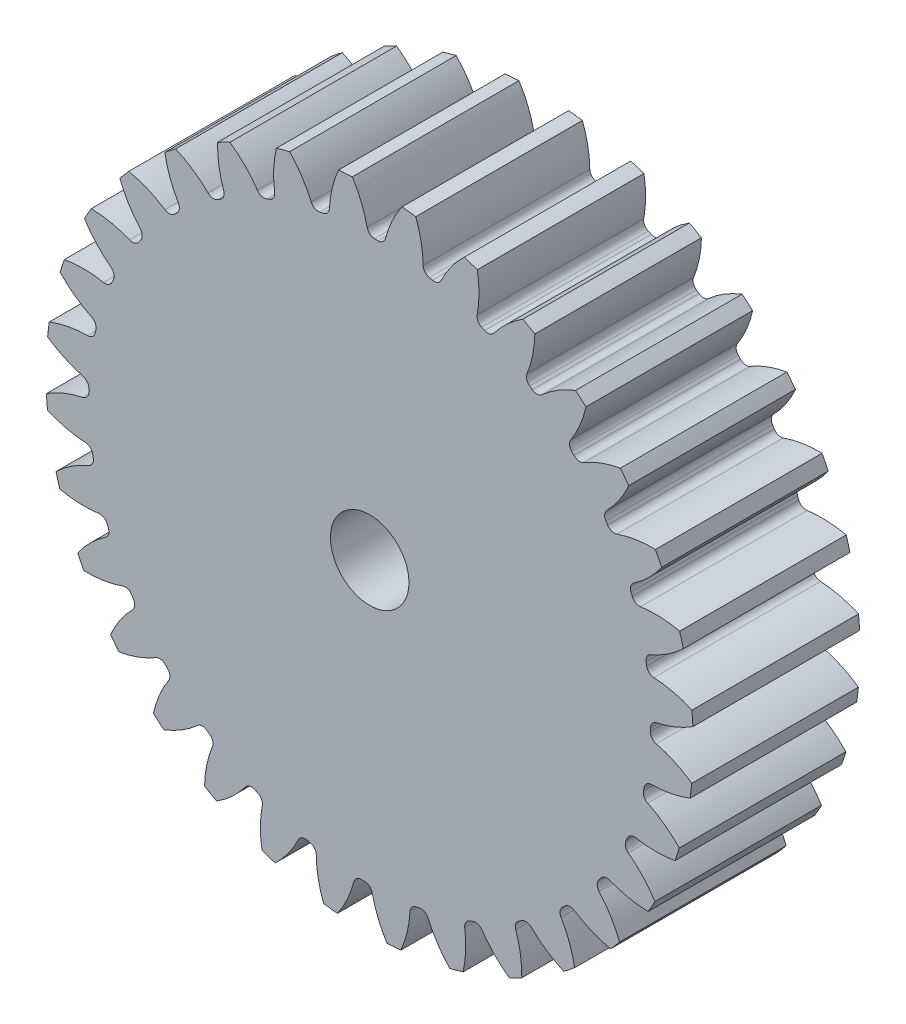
from build123d import *

# Parameters (mm, degrees)
SKETCH3_R         = 172.72
GEARBODY_DEPTH    = 88.9
TOOTHCUT_DEPTH    = 260.93769792
CIRPATTERN1_COUNT = 32
BOREDIA_R         = 20.955
BORE_DEPTH        = 12700


with BuildPart() as part:
    # Sketch3 → gearBody (new body)
    with BuildSketch(Plane.XY):
        Circle(SKETCH3_R)
    extrude(amount=GEARBODY_DEPTH)

    # Sketch2 → toothCut (cut, through all)
    with BuildSketch(Plane.XY):
        with BuildLine():
            ThreePointArc((149.797287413, -4.335006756), (149.819933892, -3.465113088), (149.837528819, -2.595102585))
            ThreePointArc((149.837528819, -2.595102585), (150.784157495, -0.03294936), (153.121718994, 1.380040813))
            ThreePointArc((153.121718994, 1.380040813), (163.289485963, 4.507854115), (172.72, 9.430465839))
            ThreePointArc((172.72, 9.430465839), (172.931012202, -3.999638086), (172.099320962, -17.405625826))
            ThreePointArc((172.099320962, -17.405625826), (162.90647452, -12.052283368), (152.89418581, -8.457735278))
            ThreePointArc((152.89418581, -8.457735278), (150.624449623, -6.938185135), (149.797287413, -4.335006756))
        make_face()
    toothcut = extrude(amount=TOOTHCUT_DEPTH, mode=Mode.SUBTRACT)

    # CirPattern1: toothCut ×32 about axis
    cirpattern1_axis = Axis((0, 0, 0), (0, 0, 1))
    for i in range(1, CIRPATTERN1_COUNT):
        add(toothcut.rotate(cirpattern1_axis, i * 360 / CIRPATTERN1_COUNT), mode=Mode.SUBTRACT)

    # boreDia → bore (cut, symmetric)
    with BuildSketch(Plane.XY):
        Circle(BOREDIA_R)
    extrude(amount=BORE_DEPTH, both=True, mode=Mode.SUBTRACT)


solid = part.part
